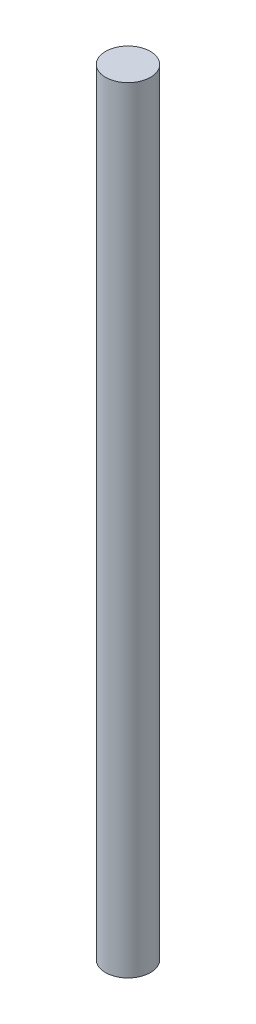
ISO-10303-21;
HEADER;
FILE_DESCRIPTION(('STEP AP214'),'2;1');
FILE_NAME('part.step','',(''),(''),'','','');
FILE_SCHEMA(('AUTOMOTIVE_DESIGN { 1 0 10303 214 1 1 1 1 }'));
ENDSEC;
DATA;
#1=APPLICATION_CONTEXT('core data for automotive mechanical design processes');
#2=APPLICATION_PROTOCOL_DEFINITION('international standard','automotive_design',2000,#1);
#3=PRODUCT_CONTEXT('',#1,'mechanical');
#4=PRODUCT('Part','Part','',(#3));
#5=PRODUCT_RELATED_PRODUCT_CATEGORY('part','',(#4));
#6=PRODUCT_DEFINITION_FORMATION('','',#4);
#7=PRODUCT_DEFINITION_CONTEXT('part definition',#1,'design');
#8=PRODUCT_DEFINITION('design','',#6,#7);
#9=PRODUCT_DEFINITION_SHAPE('','',#8);
#10=(LENGTH_UNIT() NAMED_UNIT(*) SI_UNIT(.MILLI.,.METRE.));
#11=(NAMED_UNIT(*) PLANE_ANGLE_UNIT() SI_UNIT($,.RADIAN.));
#12=(NAMED_UNIT(*) SI_UNIT($,.STERADIAN.) SOLID_ANGLE_UNIT());
#13=UNCERTAINTY_MEASURE_WITH_UNIT(LENGTH_MEASURE(1.E-05),#10,'distance_accuracy_value','');
#14=(GEOMETRIC_REPRESENTATION_CONTEXT(3) GLOBAL_UNCERTAINTY_ASSIGNED_CONTEXT((#13)) GLOBAL_UNIT_ASSIGNED_CONTEXT((#10,
#11,#12)) REPRESENTATION_CONTEXT('',''));
#15=CARTESIAN_POINT('',(0.,0.,0.));
#16=DIRECTION('',(0.,0.,1.));
#17=DIRECTION('',(1.,0.,0.));
#18=AXIS2_PLACEMENT_3D('',#15,#16,#17);
#19=CARTESIAN_POINT('',(0.,109.65778756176,0.));
#20=DIRECTION('',(0.,-1.,0.));
#21=DIRECTION('',(0.,0.,-1.));
#22=AXIS2_PLACEMENT_3D('',#19,#20,#21);
#23=CYLINDRICAL_SURFACE('',#22,6.35);
#24=CARTESIAN_POINT('',(0.,109.65778756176,0.));
#25=DIRECTION('',(0.,1.,0.));
#26=DIRECTION('',(0.,0.,1.));
#27=AXIS2_PLACEMENT_3D('',#24,#25,#26);
#28=CIRCLE('',#27,6.35);
#29=CARTESIAN_POINT('',(0.,109.65778756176,6.35000000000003));
#30=VERTEX_POINT('',#29);
#31=EDGE_CURVE('E10',#30,#30,#28,.T.);
#32=ORIENTED_EDGE('',*,*,#31,.F.);
#33=EDGE_LOOP('',(#32));
#34=FACE_BOUND('',#33,.T.);
#35=CARTESIAN_POINT('',(0.,-109.54421243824,0.));
#36=DIRECTION('',(0.,1.,0.));
#37=DIRECTION('',(0.,0.,1.));
#38=AXIS2_PLACEMENT_3D('',#35,#36,#37);
#39=CIRCLE('',#38,6.35);
#40=CARTESIAN_POINT('',(0.,-109.54421243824,6.35000000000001));
#41=VERTEX_POINT('',#40);
#42=EDGE_CURVE('E34',#41,#41,#39,.T.);
#43=ORIENTED_EDGE('',*,*,#42,.T.);
#44=EDGE_LOOP('',(#43));
#45=FACE_BOUND('',#44,.T.);
#46=ADVANCED_FACE('F31',(#34,#45),#23,.T.);
#47=CARTESIAN_POINT('',(0.,109.65778756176,0.));
#48=DIRECTION('',(0.,1.,0.));
#49=DIRECTION('',(0.,0.,1.));
#50=AXIS2_PLACEMENT_3D('',#47,#48,#49);
#51=PLANE('',#50);
#52=ORIENTED_EDGE('',*,*,#31,.T.);
#53=EDGE_LOOP('',(#52));
#54=FACE_BOUND('',#53,.T.);
#55=ADVANCED_FACE('F46',(#54),#51,.T.);
#56=CARTESIAN_POINT('',(0.,-109.54421243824,0.));
#57=DIRECTION('',(0.,1.,0.));
#58=DIRECTION('',(0.,0.,1.));
#59=AXIS2_PLACEMENT_3D('',#56,#57,#58);
#60=PLANE('',#59);
#61=ORIENTED_EDGE('',*,*,#42,.F.);
#62=EDGE_LOOP('',(#61));
#63=FACE_BOUND('',#62,.T.);
#64=ADVANCED_FACE('F44',(#63),#60,.F.);
#65=CLOSED_SHELL('',(#46,#55,#64));
#66=MANIFOLD_SOLID_BREP('B2',#65);
#67=ADVANCED_BREP_SHAPE_REPRESENTATION('',(#18,#66),#14);
#68=SHAPE_DEFINITION_REPRESENTATION(#9,#67);
ENDSEC;
END-ISO-10303-21;
